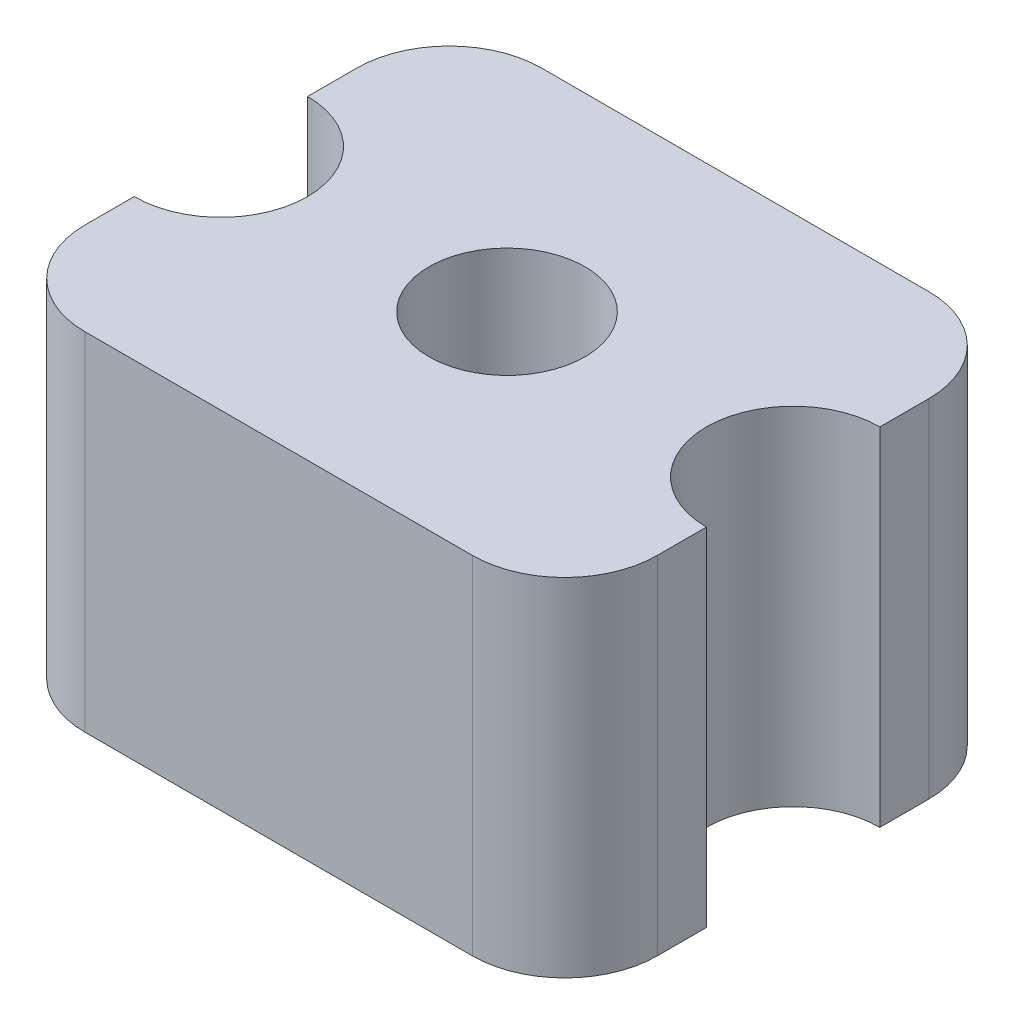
ISO-10303-21;
HEADER;
FILE_DESCRIPTION(('STEP AP214'),'2;1');
FILE_NAME('part.step','',(''),(''),'','','');
FILE_SCHEMA(('AUTOMOTIVE_DESIGN { 1 0 10303 214 1 1 1 1 }'));
ENDSEC;
DATA;
#1=APPLICATION_CONTEXT('core data for automotive mechanical design processes');
#2=APPLICATION_PROTOCOL_DEFINITION('international standard','automotive_design',2000,#1);
#3=PRODUCT_CONTEXT('',#1,'mechanical');
#4=PRODUCT('Part','Part','',(#3));
#5=PRODUCT_RELATED_PRODUCT_CATEGORY('part','',(#4));
#6=PRODUCT_DEFINITION_FORMATION('','',#4);
#7=PRODUCT_DEFINITION_CONTEXT('part definition',#1,'design');
#8=PRODUCT_DEFINITION('design','',#6,#7);
#9=PRODUCT_DEFINITION_SHAPE('','',#8);
#10=(LENGTH_UNIT() NAMED_UNIT(*) SI_UNIT(.MILLI.,.METRE.));
#11=(NAMED_UNIT(*) PLANE_ANGLE_UNIT() SI_UNIT($,.RADIAN.));
#12=(NAMED_UNIT(*) SI_UNIT($,.STERADIAN.) SOLID_ANGLE_UNIT());
#13=UNCERTAINTY_MEASURE_WITH_UNIT(LENGTH_MEASURE(1.E-05),#10,'distance_accuracy_value','');
#14=(GEOMETRIC_REPRESENTATION_CONTEXT(3) GLOBAL_UNCERTAINTY_ASSIGNED_CONTEXT((#13)) GLOBAL_UNIT_ASSIGNED_CONTEXT((#10,
#11,#12)) REPRESENTATION_CONTEXT('',''));
#15=CARTESIAN_POINT('',(0.,0.,0.));
#16=DIRECTION('',(0.,0.,1.));
#17=DIRECTION('',(1.,0.,0.));
#18=AXIS2_PLACEMENT_3D('',#15,#16,#17);
#19=CARTESIAN_POINT('',(4.95,-3.,2.35));
#20=DIRECTION('',(1.,0.,0.));
#21=DIRECTION('',(0.,0.,-1.));
#22=AXIS2_PLACEMENT_3D('',#19,#20,#21);
#23=PLANE('',#22);
#24=DIRECTION('',(0.,1.,0.));
#25=VECTOR('',#24,1.);
#26=CARTESIAN_POINT('',(4.95,-3.,2.35));
#27=LINE('',#26,#25);
#28=CARTESIAN_POINT('',(4.95,-3.,2.35));
#29=VERTEX_POINT('',#28);
#30=CARTESIAN_POINT('',(4.95,3.,2.35));
#31=VERTEX_POINT('',#30);
#32=EDGE_CURVE('E104',#29,#31,#27,.T.);
#33=ORIENTED_EDGE('',*,*,#32,.F.);
#34=DIRECTION('',(0.,0.,-1.));
#35=VECTOR('',#34,1.);
#36=CARTESIAN_POINT('',(4.95,-3.,2.35));
#37=LINE('',#36,#35);
#38=CARTESIAN_POINT('',(4.95,-3.,1.5));
#39=VERTEX_POINT('',#38);
#40=EDGE_CURVE('E149',#29,#39,#37,.T.);
#41=ORIENTED_EDGE('',*,*,#40,.T.);
#42=DIRECTION('',(0.,1.,0.));
#43=VECTOR('',#42,1.);
#44=CARTESIAN_POINT('',(4.95,-3.,1.5));
#45=LINE('',#44,#43);
#46=CARTESIAN_POINT('',(4.95,3.,1.5));
#47=VERTEX_POINT('',#46);
#48=EDGE_CURVE('E117',#39,#47,#45,.T.);
#49=ORIENTED_EDGE('',*,*,#48,.T.);
#50=DIRECTION('',(0.,0.,1.));
#51=VECTOR('',#50,1.);
#52=CARTESIAN_POINT('',(4.95,3.,0.));
#53=LINE('',#52,#51);
#54=EDGE_CURVE('E115',#31,#47,#53,.F.);
#55=ORIENTED_EDGE('',*,*,#54,.F.);
#56=EDGE_LOOP('',(#33,#41,#49,#55));
#57=FACE_BOUND('',#56,.T.);
#58=ADVANCED_FACE('F17',(#57),#23,.T.);
#59=CARTESIAN_POINT('',(4.95,-3.,-1.5));
#60=DIRECTION('',(1.,0.,0.));
#61=DIRECTION('',(0.,0.,-1.));
#62=AXIS2_PLACEMENT_3D('',#59,#60,#61);
#63=PLANE('',#62);
#64=DIRECTION('',(0.,1.,0.));
#65=VECTOR('',#64,1.);
#66=CARTESIAN_POINT('',(4.95,-3.,-1.5));
#67=LINE('',#66,#65);
#68=CARTESIAN_POINT('',(4.95,3.,-1.5));
#69=VERTEX_POINT('',#68);
#70=CARTESIAN_POINT('',(4.95,-3.,-1.5));
#71=VERTEX_POINT('',#70);
#72=EDGE_CURVE('E130',#69,#71,#67,.F.);
#73=ORIENTED_EDGE('',*,*,#72,.T.);
#74=DIRECTION('',(0.,0.,-1.));
#75=VECTOR('',#74,1.);
#76=CARTESIAN_POINT('',(4.95,-3.,-1.5));
#77=LINE('',#76,#75);
#78=CARTESIAN_POINT('',(4.95,-3.,-2.35));
#79=VERTEX_POINT('',#78);
#80=EDGE_CURVE('E143',#71,#79,#77,.T.);
#81=ORIENTED_EDGE('',*,*,#80,.T.);
#82=DIRECTION('',(0.,1.,0.));
#83=VECTOR('',#82,1.);
#84=CARTESIAN_POINT('',(4.95,-3.,-2.35));
#85=LINE('',#84,#83);
#86=CARTESIAN_POINT('',(4.95,3.,-2.35));
#87=VERTEX_POINT('',#86);
#88=EDGE_CURVE('E147',#87,#79,#85,.F.);
#89=ORIENTED_EDGE('',*,*,#88,.F.);
#90=DIRECTION('',(0.,0.,1.));
#91=VECTOR('',#90,1.);
#92=CARTESIAN_POINT('',(4.95,3.,0.));
#93=LINE('',#92,#91);
#94=EDGE_CURVE('E121',#69,#87,#93,.F.);
#95=ORIENTED_EDGE('',*,*,#94,.F.);
#96=EDGE_LOOP('',(#73,#81,#89,#95));
#97=FACE_BOUND('',#96,.T.);
#98=ADVANCED_FACE('F194',(#97),#63,.T.);
#99=CARTESIAN_POINT('',(-4.95,-3.,-2.35));
#100=DIRECTION('',(-1.,0.,0.));
#101=DIRECTION('',(0.,0.,1.));
#102=AXIS2_PLACEMENT_3D('',#99,#100,#101);
#103=PLANE('',#102);
#104=DIRECTION('',(0.,1.,0.));
#105=VECTOR('',#104,1.);
#106=CARTESIAN_POINT('',(-4.95,-3.,-2.35));
#107=LINE('',#106,#105);
#108=CARTESIAN_POINT('',(-4.95,-3.,-2.35));
#109=VERTEX_POINT('',#108);
#110=CARTESIAN_POINT('',(-4.95,3.,-2.35));
#111=VERTEX_POINT('',#110);
#112=EDGE_CURVE('E183',#109,#111,#107,.T.);
#113=ORIENTED_EDGE('',*,*,#112,.F.);
#114=DIRECTION('',(0.,0.,1.));
#115=VECTOR('',#114,1.);
#116=CARTESIAN_POINT('',(-4.95,-3.,-2.35));
#117=LINE('',#116,#115);
#118=CARTESIAN_POINT('',(-4.95,-3.,-1.5));
#119=VERTEX_POINT('',#118);
#120=EDGE_CURVE('E141',#109,#119,#117,.T.);
#121=ORIENTED_EDGE('',*,*,#120,.T.);
#122=DIRECTION('',(0.,1.,0.));
#123=VECTOR('',#122,1.);
#124=CARTESIAN_POINT('',(-4.95,-3.,-1.5));
#125=LINE('',#124,#123);
#126=CARTESIAN_POINT('',(-4.95,3.,-1.5));
#127=VERTEX_POINT('',#126);
#128=EDGE_CURVE('E179',#119,#127,#125,.T.);
#129=ORIENTED_EDGE('',*,*,#128,.T.);
#130=DIRECTION('',(0.,0.,1.));
#131=VECTOR('',#130,1.);
#132=CARTESIAN_POINT('',(-4.95,3.,0.));
#133=LINE('',#132,#131);
#134=EDGE_CURVE('E135',#111,#127,#133,.T.);
#135=ORIENTED_EDGE('',*,*,#134,.F.);
#136=EDGE_LOOP('',(#113,#121,#129,#135));
#137=FACE_BOUND('',#136,.T.);
#138=ADVANCED_FACE('F235',(#137),#103,.T.);
#139=CARTESIAN_POINT('',(-4.95,-3.,1.5));
#140=DIRECTION('',(-1.,0.,0.));
#141=DIRECTION('',(0.,0.,1.));
#142=AXIS2_PLACEMENT_3D('',#139,#140,#141);
#143=PLANE('',#142);
#144=DIRECTION('',(0.,1.,0.));
#145=VECTOR('',#144,1.);
#146=CARTESIAN_POINT('',(-4.95,-3.,1.5));
#147=LINE('',#146,#145);
#148=CARTESIAN_POINT('',(-4.95,3.,1.5));
#149=VERTEX_POINT('',#148);
#150=CARTESIAN_POINT('',(-4.95,-3.,1.5));
#151=VERTEX_POINT('',#150);
#152=EDGE_CURVE('E175',#149,#151,#147,.F.);
#153=ORIENTED_EDGE('',*,*,#152,.T.);
#154=DIRECTION('',(0.,0.,1.));
#155=VECTOR('',#154,1.);
#156=CARTESIAN_POINT('',(-4.95,-3.,1.5));
#157=LINE('',#156,#155);
#158=CARTESIAN_POINT('',(-4.95,-3.,2.35));
#159=VERTEX_POINT('',#158);
#160=EDGE_CURVE('E122',#151,#159,#157,.T.);
#161=ORIENTED_EDGE('',*,*,#160,.T.);
#162=DIRECTION('',(0.,1.,0.));
#163=VECTOR('',#162,1.);
#164=CARTESIAN_POINT('',(-4.95,-3.,2.35));
#165=LINE('',#164,#163);
#166=CARTESIAN_POINT('',(-4.95,3.,2.35));
#167=VERTEX_POINT('',#166);
#168=EDGE_CURVE('E174',#167,#159,#165,.F.);
#169=ORIENTED_EDGE('',*,*,#168,.F.);
#170=DIRECTION('',(0.,0.,1.));
#171=VECTOR('',#170,1.);
#172=CARTESIAN_POINT('',(-4.95,3.,0.));
#173=LINE('',#172,#171);
#174=EDGE_CURVE('E112',#149,#167,#173,.T.);
#175=ORIENTED_EDGE('',*,*,#174,.F.);
#176=EDGE_LOOP('',(#153,#161,#169,#175));
#177=FACE_BOUND('',#176,.T.);
#178=ADVANCED_FACE('F225',(#177),#143,.T.);
#179=CARTESIAN_POINT('',(0.,3.,0.));
#180=DIRECTION('',(0.,1.,0.));
#181=DIRECTION('',(0.,0.,1.));
#182=AXIS2_PLACEMENT_3D('',#179,#180,#181);
#183=PLANE('',#182);
#184=CARTESIAN_POINT('',(0.,3.,0.));
#185=DIRECTION('',(0.,1.,0.));
#186=DIRECTION('',(0.,0.,1.));
#187=AXIS2_PLACEMENT_3D('',#184,#185,#186);
#188=CIRCLE('',#187,1.35);
#189=CARTESIAN_POINT('',(0.,3.,1.35));
#190=VERTEX_POINT('',#189);
#191=EDGE_CURVE('E168',#190,#190,#188,.F.);
#192=ORIENTED_EDGE('',*,*,#191,.T.);
#193=EDGE_LOOP('',(#192));
#194=FACE_BOUND('',#193,.T.);
#195=DIRECTION('',(1.,0.,0.));
#196=VECTOR('',#195,1.);
#197=CARTESIAN_POINT('',(-3.35,3.,3.95));
#198=LINE('',#197,#196);
#199=CARTESIAN_POINT('',(3.35,3.,3.95));
#200=VERTEX_POINT('',#199);
#201=CARTESIAN_POINT('',(-3.35,3.,3.95));
#202=VERTEX_POINT('',#201);
#203=EDGE_CURVE('E127',#200,#202,#198,.F.);
#204=ORIENTED_EDGE('',*,*,#203,.F.);
#205=CARTESIAN_POINT('',(3.35,3.,2.35));
#206=DIRECTION('',(0.,1.,0.));
#207=DIRECTION('',(0.,0.,1.));
#208=AXIS2_PLACEMENT_3D('',#205,#206,#207);
#209=CIRCLE('',#208,1.6);
#210=EDGE_CURVE('E20',#31,#200,#209,.F.);
#211=ORIENTED_EDGE('',*,*,#210,.F.);
#212=ORIENTED_EDGE('',*,*,#54,.T.);
#213=CARTESIAN_POINT('',(4.95,3.,0.));
#214=DIRECTION('',(0.,1.,0.));
#215=DIRECTION('',(0.,0.,1.));
#216=AXIS2_PLACEMENT_3D('',#213,#214,#215);
#217=CIRCLE('',#216,1.5);
#218=EDGE_CURVE('E128',#47,#69,#217,.F.);
#219=ORIENTED_EDGE('',*,*,#218,.T.);
#220=ORIENTED_EDGE('',*,*,#94,.T.);
#221=CARTESIAN_POINT('',(3.35,3.,-2.35));
#222=DIRECTION('',(0.,1.,0.));
#223=DIRECTION('',(0.,0.,1.));
#224=AXIS2_PLACEMENT_3D('',#221,#222,#223);
#225=CIRCLE('',#224,1.6);
#226=CARTESIAN_POINT('',(3.35,3.,-3.95));
#227=VERTEX_POINT('',#226);
#228=EDGE_CURVE('E184',#227,#87,#225,.F.);
#229=ORIENTED_EDGE('',*,*,#228,.F.);
#230=DIRECTION('',(-1.,0.,0.));
#231=VECTOR('',#230,1.);
#232=CARTESIAN_POINT('',(3.35,3.,-3.95));
#233=LINE('',#232,#231);
#234=CARTESIAN_POINT('',(-3.35,3.,-3.95));
#235=VERTEX_POINT('',#234);
#236=EDGE_CURVE('E144',#235,#227,#233,.F.);
#237=ORIENTED_EDGE('',*,*,#236,.F.);
#238=CARTESIAN_POINT('',(-3.35,3.,-2.35));
#239=DIRECTION('',(0.,1.,0.));
#240=DIRECTION('',(0.,0.,1.));
#241=AXIS2_PLACEMENT_3D('',#238,#239,#240);
#242=CIRCLE('',#241,1.6);
#243=EDGE_CURVE('E180',#111,#235,#242,.F.);
#244=ORIENTED_EDGE('',*,*,#243,.F.);
#245=ORIENTED_EDGE('',*,*,#134,.T.);
#246=CARTESIAN_POINT('',(-4.95,3.,0.));
#247=DIRECTION('',(0.,1.,0.));
#248=DIRECTION('',(0.,0.,1.));
#249=AXIS2_PLACEMENT_3D('',#246,#247,#248);
#250=CIRCLE('',#249,1.5);
#251=EDGE_CURVE('E176',#127,#149,#250,.F.);
#252=ORIENTED_EDGE('',*,*,#251,.T.);
#253=ORIENTED_EDGE('',*,*,#174,.T.);
#254=CARTESIAN_POINT('',(-3.35,3.,2.35));
#255=DIRECTION('',(0.,1.,0.));
#256=DIRECTION('',(0.,0.,1.));
#257=AXIS2_PLACEMENT_3D('',#254,#255,#256);
#258=CIRCLE('',#257,1.6);
#259=EDGE_CURVE('E171',#202,#167,#258,.F.);
#260=ORIENTED_EDGE('',*,*,#259,.F.);
#261=EDGE_LOOP('',(#204,#211,#212,#219,#220,#229,#237,#244,#245,#252,#253,#260));
#262=FACE_BOUND('',#261,.T.);
#263=ADVANCED_FACE('F125',(#194,#262),#183,.T.);
#264=CARTESIAN_POINT('',(3.35,-3.,2.35));
#265=DIRECTION('',(0.,1.,0.));
#266=DIRECTION('',(0.,0.,1.));
#267=AXIS2_PLACEMENT_3D('',#264,#265,#266);
#268=CYLINDRICAL_SURFACE('',#267,1.6);
#269=DIRECTION('',(0.,1.,0.));
#270=VECTOR('',#269,1.);
#271=CARTESIAN_POINT('',(3.35,-3.,3.95));
#272=LINE('',#271,#270);
#273=CARTESIAN_POINT('',(3.35,-3.,3.95));
#274=VERTEX_POINT('',#273);
#275=EDGE_CURVE('E139',#274,#200,#272,.T.);
#276=ORIENTED_EDGE('',*,*,#275,.F.);
#277=CARTESIAN_POINT('',(3.35,-3.,2.35));
#278=DIRECTION('',(0.,1.,0.));
#279=DIRECTION('',(0.,0.,1.));
#280=AXIS2_PLACEMENT_3D('',#277,#278,#279);
#281=CIRCLE('',#280,1.6);
#282=EDGE_CURVE('E110',#274,#29,#281,.T.);
#283=ORIENTED_EDGE('',*,*,#282,.T.);
#284=ORIENTED_EDGE('',*,*,#32,.T.);
#285=ORIENTED_EDGE('',*,*,#210,.T.);
#286=EDGE_LOOP('',(#276,#283,#284,#285));
#287=FACE_BOUND('',#286,.T.);
#288=ADVANCED_FACE('F107',(#287),#268,.T.);
#289=CARTESIAN_POINT('',(4.95,-3.,0.));
#290=DIRECTION('',(0.,1.,0.));
#291=DIRECTION('',(0.,0.,1.));
#292=AXIS2_PLACEMENT_3D('',#289,#290,#291);
#293=CYLINDRICAL_SURFACE('',#292,1.5);
#294=ORIENTED_EDGE('',*,*,#218,.F.);
#295=ORIENTED_EDGE('',*,*,#48,.F.);
#296=CARTESIAN_POINT('',(4.95,-3.,0.));
#297=DIRECTION('',(0.,1.,0.));
#298=DIRECTION('',(0.,0.,1.));
#299=AXIS2_PLACEMENT_3D('',#296,#297,#298);
#300=CIRCLE('',#299,1.5);
#301=EDGE_CURVE('E164',#39,#71,#300,.F.);
#302=ORIENTED_EDGE('',*,*,#301,.T.);
#303=ORIENTED_EDGE('',*,*,#72,.F.);
#304=EDGE_LOOP('',(#294,#295,#302,#303));
#305=FACE_BOUND('',#304,.T.);
#306=ADVANCED_FACE('F197',(#305),#293,.F.);
#307=CARTESIAN_POINT('',(3.35,-3.,-2.35));
#308=DIRECTION('',(0.,1.,0.));
#309=DIRECTION('',(0.,0.,1.));
#310=AXIS2_PLACEMENT_3D('',#307,#308,#309);
#311=CYLINDRICAL_SURFACE('',#310,1.6);
#312=ORIENTED_EDGE('',*,*,#88,.T.);
#313=CARTESIAN_POINT('',(3.35,-3.,-2.35));
#314=DIRECTION('',(0.,1.,0.));
#315=DIRECTION('',(0.,0.,1.));
#316=AXIS2_PLACEMENT_3D('',#313,#314,#315);
#317=CIRCLE('',#316,1.6);
#318=CARTESIAN_POINT('',(3.35,-3.,-3.95));
#319=VERTEX_POINT('',#318);
#320=EDGE_CURVE('E161',#79,#319,#317,.T.);
#321=ORIENTED_EDGE('',*,*,#320,.T.);
#322=DIRECTION('',(0.,1.,0.));
#323=VECTOR('',#322,1.);
#324=CARTESIAN_POINT('',(3.35,-3.,-3.95));
#325=LINE('',#324,#323);
#326=EDGE_CURVE('E146',#227,#319,#325,.F.);
#327=ORIENTED_EDGE('',*,*,#326,.F.);
#328=ORIENTED_EDGE('',*,*,#228,.T.);
#329=EDGE_LOOP('',(#312,#321,#327,#328));
#330=FACE_BOUND('',#329,.T.);
#331=ADVANCED_FACE('F205',(#330),#311,.T.);
#332=CARTESIAN_POINT('',(3.35,-3.,-3.95));
#333=DIRECTION('',(0.,0.,-1.));
#334=DIRECTION('',(-1.,0.,0.));
#335=AXIS2_PLACEMENT_3D('',#332,#333,#334);
#336=PLANE('',#335);
#337=ORIENTED_EDGE('',*,*,#326,.T.);
#338=DIRECTION('',(1.,0.,0.));
#339=VECTOR('',#338,1.);
#340=CARTESIAN_POINT('',(0.,-3.,-3.95));
#341=LINE('',#340,#339);
#342=CARTESIAN_POINT('',(-3.35,-3.,-3.95));
#343=VERTEX_POINT('',#342);
#344=EDGE_CURVE('E160',#319,#343,#341,.F.);
#345=ORIENTED_EDGE('',*,*,#344,.T.);
#346=DIRECTION('',(0.,1.,0.));
#347=VECTOR('',#346,1.);
#348=CARTESIAN_POINT('',(-3.35,-3.,-3.95));
#349=LINE('',#348,#347);
#350=EDGE_CURVE('E182',#235,#343,#349,.F.);
#351=ORIENTED_EDGE('',*,*,#350,.F.);
#352=ORIENTED_EDGE('',*,*,#236,.T.);
#353=EDGE_LOOP('',(#337,#345,#351,#352));
#354=FACE_BOUND('',#353,.T.);
#355=ADVANCED_FACE('F240',(#354),#336,.T.);
#356=CARTESIAN_POINT('',(-3.35,-3.,-2.35));
#357=DIRECTION('',(0.,1.,0.));
#358=DIRECTION('',(0.,0.,1.));
#359=AXIS2_PLACEMENT_3D('',#356,#357,#358);
#360=CYLINDRICAL_SURFACE('',#359,1.6);
#361=ORIENTED_EDGE('',*,*,#350,.T.);
#362=CARTESIAN_POINT('',(-3.35,-3.,-2.35));
#363=DIRECTION('',(0.,1.,0.));
#364=DIRECTION('',(0.,0.,1.));
#365=AXIS2_PLACEMENT_3D('',#362,#363,#364);
#366=CIRCLE('',#365,1.6);
#367=EDGE_CURVE('E157',#343,#109,#366,.T.);
#368=ORIENTED_EDGE('',*,*,#367,.T.);
#369=ORIENTED_EDGE('',*,*,#112,.T.);
#370=ORIENTED_EDGE('',*,*,#243,.T.);
#371=EDGE_LOOP('',(#361,#368,#369,#370));
#372=FACE_BOUND('',#371,.T.);
#373=ADVANCED_FACE('F238',(#372),#360,.T.);
#374=CARTESIAN_POINT('',(-4.95,-3.,0.));
#375=DIRECTION('',(0.,1.,0.));
#376=DIRECTION('',(0.,0.,1.));
#377=AXIS2_PLACEMENT_3D('',#374,#375,#376);
#378=CYLINDRICAL_SURFACE('',#377,1.5);
#379=ORIENTED_EDGE('',*,*,#251,.F.);
#380=ORIENTED_EDGE('',*,*,#128,.F.);
#381=CARTESIAN_POINT('',(-4.95,-3.,0.));
#382=DIRECTION('',(0.,1.,0.));
#383=DIRECTION('',(0.,0.,1.));
#384=AXIS2_PLACEMENT_3D('',#381,#382,#383);
#385=CIRCLE('',#384,1.5);
#386=EDGE_CURVE('E154',#119,#151,#385,.F.);
#387=ORIENTED_EDGE('',*,*,#386,.T.);
#388=ORIENTED_EDGE('',*,*,#152,.F.);
#389=EDGE_LOOP('',(#379,#380,#387,#388));
#390=FACE_BOUND('',#389,.T.);
#391=ADVANCED_FACE('F232',(#390),#378,.F.);
#392=CARTESIAN_POINT('',(-3.35,-3.,2.35));
#393=DIRECTION('',(0.,1.,0.));
#394=DIRECTION('',(0.,0.,1.));
#395=AXIS2_PLACEMENT_3D('',#392,#393,#394);
#396=CYLINDRICAL_SURFACE('',#395,1.6);
#397=ORIENTED_EDGE('',*,*,#168,.T.);
#398=CARTESIAN_POINT('',(-3.35,-3.,2.35));
#399=DIRECTION('',(0.,1.,0.));
#400=DIRECTION('',(0.,0.,1.));
#401=AXIS2_PLACEMENT_3D('',#398,#399,#400);
#402=CIRCLE('',#401,1.6);
#403=CARTESIAN_POINT('',(-3.35,-3.,3.95));
#404=VERTEX_POINT('',#403);
#405=EDGE_CURVE('E151',#159,#404,#402,.T.);
#406=ORIENTED_EDGE('',*,*,#405,.T.);
#407=DIRECTION('',(0.,1.,0.));
#408=VECTOR('',#407,1.);
#409=CARTESIAN_POINT('',(-3.35,-3.,3.95));
#410=LINE('',#409,#408);
#411=EDGE_CURVE('E35',#202,#404,#410,.F.);
#412=ORIENTED_EDGE('',*,*,#411,.F.);
#413=ORIENTED_EDGE('',*,*,#259,.T.);
#414=EDGE_LOOP('',(#397,#406,#412,#413));
#415=FACE_BOUND('',#414,.T.);
#416=ADVANCED_FACE('F222',(#415),#396,.T.);
#417=CARTESIAN_POINT('',(-3.35,-3.,3.95));
#418=DIRECTION('',(0.,0.,1.));
#419=DIRECTION('',(1.,0.,0.));
#420=AXIS2_PLACEMENT_3D('',#417,#418,#419);
#421=PLANE('',#420);
#422=ORIENTED_EDGE('',*,*,#411,.T.);
#423=DIRECTION('',(1.,0.,0.));
#424=VECTOR('',#423,1.);
#425=CARTESIAN_POINT('',(0.,-3.,3.95));
#426=LINE('',#425,#424);
#427=EDGE_CURVE('E26',#404,#274,#426,.T.);
#428=ORIENTED_EDGE('',*,*,#427,.T.);
#429=ORIENTED_EDGE('',*,*,#275,.T.);
#430=ORIENTED_EDGE('',*,*,#203,.T.);
#431=EDGE_LOOP('',(#422,#428,#429,#430));
#432=FACE_BOUND('',#431,.T.);
#433=ADVANCED_FACE('F220',(#432),#421,.T.);
#434=CARTESIAN_POINT('',(0.,-3.,0.));
#435=DIRECTION('',(0.,1.,0.));
#436=DIRECTION('',(0.,0.,1.));
#437=AXIS2_PLACEMENT_3D('',#434,#435,#436);
#438=CYLINDRICAL_SURFACE('',#437,1.35);
#439=ORIENTED_EDGE('',*,*,#191,.F.);
#440=EDGE_LOOP('',(#439));
#441=FACE_BOUND('',#440,.T.);
#442=CARTESIAN_POINT('',(0.,-3.,0.));
#443=DIRECTION('',(0.,1.,0.));
#444=DIRECTION('',(0.,0.,1.));
#445=AXIS2_PLACEMENT_3D('',#442,#443,#444);
#446=CIRCLE('',#445,1.35);
#447=CARTESIAN_POINT('',(0.,-3.,1.35));
#448=VERTEX_POINT('',#447);
#449=EDGE_CURVE('E11',#448,#448,#446,.F.);
#450=ORIENTED_EDGE('',*,*,#449,.T.);
#451=EDGE_LOOP('',(#450));
#452=FACE_BOUND('',#451,.T.);
#453=ADVANCED_FACE('F252',(#441,#452),#438,.F.);
#454=CARTESIAN_POINT('',(0.,-3.,0.));
#455=DIRECTION('',(0.,1.,0.));
#456=DIRECTION('',(0.,0.,1.));
#457=AXIS2_PLACEMENT_3D('',#454,#455,#456);
#458=PLANE('',#457);
#459=ORIENTED_EDGE('',*,*,#449,.F.);
#460=EDGE_LOOP('',(#459));
#461=FACE_BOUND('',#460,.T.);
#462=ORIENTED_EDGE('',*,*,#405,.F.);
#463=ORIENTED_EDGE('',*,*,#160,.F.);
#464=ORIENTED_EDGE('',*,*,#386,.F.);
#465=ORIENTED_EDGE('',*,*,#120,.F.);
#466=ORIENTED_EDGE('',*,*,#367,.F.);
#467=ORIENTED_EDGE('',*,*,#344,.F.);
#468=ORIENTED_EDGE('',*,*,#320,.F.);
#469=ORIENTED_EDGE('',*,*,#80,.F.);
#470=ORIENTED_EDGE('',*,*,#301,.F.);
#471=ORIENTED_EDGE('',*,*,#40,.F.);
#472=ORIENTED_EDGE('',*,*,#282,.F.);
#473=ORIENTED_EDGE('',*,*,#427,.F.);
#474=EDGE_LOOP('',(#462,#463,#464,#465,#466,#467,#468,#469,#470,#471,#472,#473));
#475=FACE_BOUND('',#474,.T.);
#476=ADVANCED_FACE('F200',(#461,#475),#458,.F.);
#477=CLOSED_SHELL('',(#58,#98,#138,#178,#263,#288,#306,#331,#355,#373,#391,#416,#433,#453,#476));
#478=MANIFOLD_SOLID_BREP('B1',#477);
#479=ADVANCED_BREP_SHAPE_REPRESENTATION('',(#18,#478),#14);
#480=SHAPE_DEFINITION_REPRESENTATION(#9,#479);
ENDSEC;
END-ISO-10303-21;
